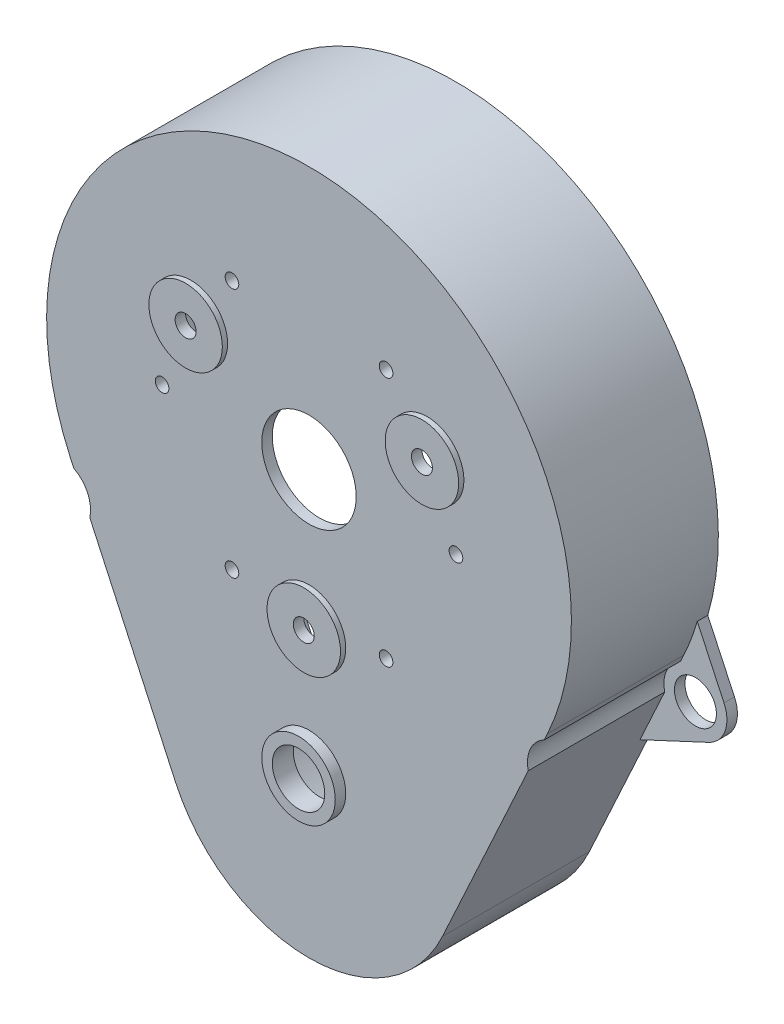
ISO-10303-21;
HEADER;
FILE_DESCRIPTION(('STEP AP214'),'2;1');
FILE_NAME('part.step','',(''),(''),'','','');
FILE_SCHEMA(('AUTOMOTIVE_DESIGN { 1 0 10303 214 1 1 1 1 }'));
ENDSEC;
DATA;
#1=APPLICATION_CONTEXT('core data for automotive mechanical design processes');
#2=APPLICATION_PROTOCOL_DEFINITION('international standard','automotive_design',2000,#1);
#3=PRODUCT_CONTEXT('',#1,'mechanical');
#4=PRODUCT('Part','Part','',(#3));
#5=PRODUCT_RELATED_PRODUCT_CATEGORY('part','',(#4));
#6=PRODUCT_DEFINITION_FORMATION('','',#4);
#7=PRODUCT_DEFINITION_CONTEXT('part definition',#1,'design');
#8=PRODUCT_DEFINITION('design','',#6,#7);
#9=PRODUCT_DEFINITION_SHAPE('','',#8);
#10=(LENGTH_UNIT() NAMED_UNIT(*) SI_UNIT(.MILLI.,.METRE.));
#11=(NAMED_UNIT(*) PLANE_ANGLE_UNIT() SI_UNIT($,.RADIAN.));
#12=(NAMED_UNIT(*) SI_UNIT($,.STERADIAN.) SOLID_ANGLE_UNIT());
#13=UNCERTAINTY_MEASURE_WITH_UNIT(LENGTH_MEASURE(1.E-05),#10,'distance_accuracy_value','');
#14=(GEOMETRIC_REPRESENTATION_CONTEXT(3) GLOBAL_UNCERTAINTY_ASSIGNED_CONTEXT((#13)) GLOBAL_UNIT_ASSIGNED_CONTEXT((#10,
#11,#12)) REPRESENTATION_CONTEXT('',''));
#15=CARTESIAN_POINT('',(0.,0.,0.));
#16=DIRECTION('',(0.,0.,1.));
#17=DIRECTION('',(1.,0.,0.));
#18=AXIS2_PLACEMENT_3D('',#15,#16,#17);
#19=CARTESIAN_POINT('',(0.,-26.3,14.));
#20=DIRECTION('',(0.,0.,1.));
#21=DIRECTION('',(1.,0.,0.));
#22=AXIS2_PLACEMENT_3D('',#19,#20,#21);
#23=PLANE('',#22);
#24=CARTESIAN_POINT('',(11.2583302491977,6.50000000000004,14.));
#25=DIRECTION('',(0.,0.,1.));
#26=DIRECTION('',(1.,0.,0.));
#27=AXIS2_PLACEMENT_3D('',#24,#25,#26);
#28=CIRCLE('',#27,3.5);
#29=CARTESIAN_POINT('',(14.7583302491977,6.50000000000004,14.));
#30=VERTEX_POINT('',#29);
#31=EDGE_CURVE('E332',#30,#30,#28,.T.);
#32=ORIENTED_EDGE('',*,*,#31,.F.);
#33=EDGE_LOOP('',(#32));
#34=FACE_BOUND('',#33,.T.);
#35=CARTESIAN_POINT('',(0.,-13.,14.));
#36=DIRECTION('',(0.,0.,1.));
#37=DIRECTION('',(1.,0.,0.));
#38=AXIS2_PLACEMENT_3D('',#35,#36,#37);
#39=CIRCLE('',#38,3.5);
#40=CARTESIAN_POINT('',(3.49999999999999,-13.,14.));
#41=VERTEX_POINT('',#40);
#42=EDGE_CURVE('E344',#41,#41,#39,.T.);
#43=ORIENTED_EDGE('',*,*,#42,.F.);
#44=EDGE_LOOP('',(#43));
#45=FACE_BOUND('',#44,.T.);
#46=CARTESIAN_POINT('',(0.,0.,14.));
#47=DIRECTION('',(0.,0.,-1.));
#48=DIRECTION('',(-1.,0.,0.));
#49=AXIS2_PLACEMENT_3D('',#46,#47,#48);
#50=CIRCLE('',#49,4.5);
#51=CARTESIAN_POINT('',(-4.5,0.,14.));
#52=VERTEX_POINT('',#51);
#53=EDGE_CURVE('E371',#52,#52,#50,.T.);
#54=ORIENTED_EDGE('',*,*,#53,.T.);
#55=EDGE_LOOP('',(#54));
#56=FACE_BOUND('',#55,.T.);
#57=CARTESIAN_POINT('',(7.34258809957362,11.92,14.));
#58=DIRECTION('',(0.,0.,-1.));
#59=DIRECTION('',(-1.,0.,0.));
#60=AXIS2_PLACEMENT_3D('',#57,#58,#59);
#61=CIRCLE('',#60,0.65);
#62=CARTESIAN_POINT('',(6.69258809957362,11.92,14.));
#63=VERTEX_POINT('',#62);
#64=EDGE_CURVE('E380',#63,#63,#61,.T.);
#65=ORIENTED_EDGE('',*,*,#64,.T.);
#66=EDGE_LOOP('',(#65));
#67=FACE_BOUND('',#66,.T.);
#68=CARTESIAN_POINT('',(14.,0.,14.));
#69=DIRECTION('',(0.,0.,-1.));
#70=DIRECTION('',(-1.,0.,0.));
#71=AXIS2_PLACEMENT_3D('',#68,#69,#70);
#72=CIRCLE('',#71,0.649999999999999);
#73=CARTESIAN_POINT('',(13.35,0.,14.));
#74=VERTEX_POINT('',#73);
#75=EDGE_CURVE('E386',#74,#74,#72,.T.);
#76=ORIENTED_EDGE('',*,*,#75,.T.);
#77=EDGE_LOOP('',(#76));
#78=FACE_BOUND('',#77,.T.);
#79=CARTESIAN_POINT('',(7.34258809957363,-11.92,14.));
#80=DIRECTION('',(0.,0.,-1.));
#81=DIRECTION('',(-1.,0.,0.));
#82=AXIS2_PLACEMENT_3D('',#79,#80,#81);
#83=CIRCLE('',#82,0.65);
#84=CARTESIAN_POINT('',(6.69258809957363,-11.92,14.));
#85=VERTEX_POINT('',#84);
#86=EDGE_CURVE('E392',#85,#85,#83,.T.);
#87=ORIENTED_EDGE('',*,*,#86,.T.);
#88=EDGE_LOOP('',(#87));
#89=FACE_BOUND('',#88,.T.);
#90=CARTESIAN_POINT('',(-7.34258809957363,-11.92,14.));
#91=DIRECTION('',(0.,0.,-1.));
#92=DIRECTION('',(-1.,0.,0.));
#93=AXIS2_PLACEMENT_3D('',#90,#91,#92);
#94=CIRCLE('',#93,0.65);
#95=CARTESIAN_POINT('',(-7.99258809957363,-11.92,14.));
#96=VERTEX_POINT('',#95);
#97=EDGE_CURVE('E398',#96,#96,#94,.T.);
#98=ORIENTED_EDGE('',*,*,#97,.T.);
#99=EDGE_LOOP('',(#98));
#100=FACE_BOUND('',#99,.T.);
#101=CARTESIAN_POINT('',(-14.,0.,14.));
#102=DIRECTION('',(0.,0.,-1.));
#103=DIRECTION('',(-1.,0.,0.));
#104=AXIS2_PLACEMENT_3D('',#101,#102,#103);
#105=CIRCLE('',#104,0.649999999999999);
#106=CARTESIAN_POINT('',(-14.65,0.,14.));
#107=VERTEX_POINT('',#106);
#108=EDGE_CURVE('E404',#107,#107,#105,.T.);
#109=ORIENTED_EDGE('',*,*,#108,.T.);
#110=EDGE_LOOP('',(#109));
#111=FACE_BOUND('',#110,.T.);
#112=CARTESIAN_POINT('',(-7.34258809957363,11.92,14.));
#113=DIRECTION('',(0.,0.,-1.));
#114=DIRECTION('',(-1.,0.,0.));
#115=AXIS2_PLACEMENT_3D('',#112,#113,#114);
#116=CIRCLE('',#115,0.65);
#117=CARTESIAN_POINT('',(-7.99258809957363,11.92,14.));
#118=VERTEX_POINT('',#117);
#119=EDGE_CURVE('E174',#118,#118,#116,.T.);
#120=ORIENTED_EDGE('',*,*,#119,.T.);
#121=EDGE_LOOP('',(#120));
#122=FACE_BOUND('',#121,.T.);
#123=DIRECTION('',(0.41825095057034,-0.9083315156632,0.));
#124=VECTOR('',#123,1.);
#125=CARTESIAN_POINT('',(-22.70828789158,-10.4562737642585,14.));
#126=LINE('',#125,#124);
#127=CARTESIAN_POINT('',(-22.70828789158,-10.4562737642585,14.));
#128=VERTEX_POINT('',#127);
#129=CARTESIAN_POINT('',(-22.4126566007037,-11.0983074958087,14.));
#130=VERTEX_POINT('',#129);
#131=EDGE_CURVE('E294',#128,#130,#126,.T.);
#132=ORIENTED_EDGE('',*,*,#131,.T.);
#133=CARTESIAN_POINT('',(-23.8156986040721,-13.7499999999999,14.));
#134=DIRECTION('',(0.,0.,1.));
#135=DIRECTION('',(1.,0.,0.));
#136=AXIS2_PLACEMENT_3D('',#133,#134,#135);
#137=CIRCLE('',#136,3.);
#138=CARTESIAN_POINT('',(-20.8887239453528,-14.407890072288,14.));
#139=VERTEX_POINT('',#138);
#140=EDGE_CURVE('E173',#139,#130,#137,.T.);
#141=ORIENTED_EDGE('',*,*,#140,.F.);
#142=CARTESIAN_POINT('',(-12.7166412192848,-32.1555133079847,14.));
#143=VERTEX_POINT('',#142);
#144=EDGE_CURVE('E182',#139,#143,#126,.T.);
#145=ORIENTED_EDGE('',*,*,#144,.T.);
#146=CARTESIAN_POINT('',(0.,-26.3,14.));
#147=DIRECTION('',(0.,0.,1.));
#148=DIRECTION('',(1.,0.,0.));
#149=AXIS2_PLACEMENT_3D('',#146,#147,#148);
#150=CIRCLE('',#149,14.);
#151=CARTESIAN_POINT('',(12.7166412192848,-32.1555133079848,14.));
#152=VERTEX_POINT('',#151);
#153=EDGE_CURVE('E285',#143,#152,#150,.T.);
#154=ORIENTED_EDGE('',*,*,#153,.T.);
#155=DIRECTION('',(0.41825095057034,0.908331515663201,0.));
#156=VECTOR('',#155,1.);
#157=CARTESIAN_POINT('',(12.7166412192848,-32.1555133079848,14.));
#158=LINE('',#157,#156);
#159=CARTESIAN_POINT('',(20.8887239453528,-14.407890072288,14.));
#160=VERTEX_POINT('',#159);
#161=EDGE_CURVE('E289',#152,#160,#158,.T.);
#162=ORIENTED_EDGE('',*,*,#161,.T.);
#163=CARTESIAN_POINT('',(23.8156986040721,-13.7499999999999,14.));
#164=DIRECTION('',(0.,0.,1.));
#165=DIRECTION('',(1.,0.,0.));
#166=AXIS2_PLACEMENT_3D('',#163,#164,#165);
#167=CIRCLE('',#166,3.);
#168=CARTESIAN_POINT('',(22.4126566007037,-11.0983074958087,14.));
#169=VERTEX_POINT('',#168);
#170=EDGE_CURVE('E415',#169,#160,#167,.T.);
#171=ORIENTED_EDGE('',*,*,#170,.F.);
#172=CARTESIAN_POINT('',(22.70828789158,-10.4562737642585,14.));
#173=VERTEX_POINT('',#172);
#174=EDGE_CURVE('E288',#169,#173,#158,.T.);
#175=ORIENTED_EDGE('',*,*,#174,.T.);
#176=CARTESIAN_POINT('',(0.,0.,14.));
#177=DIRECTION('',(0.,0.,1.));
#178=DIRECTION('',(1.,0.,0.));
#179=AXIS2_PLACEMENT_3D('',#176,#177,#178);
#180=CIRCLE('',#179,24.9999999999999);
#181=EDGE_CURVE('E292',#173,#128,#180,.T.);
#182=ORIENTED_EDGE('',*,*,#181,.T.);
#183=EDGE_LOOP('',(#132,#141,#145,#154,#162,#171,#175,#182));
#184=FACE_BOUND('',#183,.T.);
#185=CARTESIAN_POINT('',(-11.2583302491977,6.50000000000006,14.));
#186=DIRECTION('',(0.,0.,1.));
#187=DIRECTION('',(1.,0.,0.));
#188=AXIS2_PLACEMENT_3D('',#185,#186,#187);
#189=CIRCLE('',#188,3.5);
#190=CARTESIAN_POINT('',(-7.75833024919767,6.50000000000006,14.));
#191=VERTEX_POINT('',#190);
#192=EDGE_CURVE('E338',#191,#191,#189,.T.);
#193=ORIENTED_EDGE('',*,*,#192,.F.);
#194=EDGE_LOOP('',(#193));
#195=FACE_BOUND('',#194,.T.);
#196=CARTESIAN_POINT('',(0.,-25.,14.));
#197=DIRECTION('',(0.,0.,1.));
#198=DIRECTION('',(1.,0.,0.));
#199=AXIS2_PLACEMENT_3D('',#196,#197,#198);
#200=CIRCLE('',#199,3.5);
#201=CARTESIAN_POINT('',(3.5,-25.,14.));
#202=VERTEX_POINT('',#201);
#203=EDGE_CURVE('E326',#202,#202,#200,.T.);
#204=ORIENTED_EDGE('',*,*,#203,.F.);
#205=EDGE_LOOP('',(#204));
#206=FACE_BOUND('',#205,.T.);
#207=ADVANCED_FACE('F27',(#34,#45,#56,#67,#78,#89,#100,#111,#122,#184,#195,#206),#23,.T.);
#208=CARTESIAN_POINT('',(-22.70828789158,-10.4562737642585,14.));
#209=DIRECTION('',(0.908331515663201,0.41825095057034,0.));
#210=DIRECTION('',(-0.41825095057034,0.9083315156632,0.));
#211=AXIS2_PLACEMENT_3D('',#208,#209,#210);
#212=PLANE('',#211);
#213=DIRECTION('',(0.,0.,-1.));
#214=VECTOR('',#213,1.);
#215=CARTESIAN_POINT('',(-20.8887239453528,-14.407890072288,14.));
#216=LINE('',#215,#214);
#217=CARTESIAN_POINT('',(-20.8887239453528,-14.407890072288,1.));
#218=VERTEX_POINT('',#217);
#219=EDGE_CURVE('E168',#139,#218,#216,.T.);
#220=ORIENTED_EDGE('',*,*,#219,.T.);
#221=DIRECTION('',(0.41825095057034,-0.9083315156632,0.));
#222=VECTOR('',#221,1.);
#223=CARTESIAN_POINT('',(-22.70828789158,-10.4562737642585,1.));
#224=LINE('',#223,#222);
#225=CARTESIAN_POINT('',(-18.5332397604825,-19.5233847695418,1.));
#226=VERTEX_POINT('',#225);
#227=EDGE_CURVE('E179',#218,#226,#224,.T.);
#228=ORIENTED_EDGE('',*,*,#227,.T.);
#229=DIRECTION('',(0.,0.,-1.));
#230=VECTOR('',#229,1.);
#231=CARTESIAN_POINT('',(-18.5332397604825,-19.5233847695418,1.));
#232=LINE('',#231,#230);
#233=CARTESIAN_POINT('',(-18.5332397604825,-19.5233847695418,0.));
#234=VERTEX_POINT('',#233);
#235=EDGE_CURVE('E201',#226,#234,#232,.T.);
#236=ORIENTED_EDGE('',*,*,#235,.T.);
#237=DIRECTION('',(0.41825095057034,-0.9083315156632,0.));
#238=VECTOR('',#237,1.);
#239=CARTESIAN_POINT('',(-22.70828789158,-10.4562737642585,0.));
#240=LINE('',#239,#238);
#241=CARTESIAN_POINT('',(-12.7166412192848,-32.1555133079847,0.));
#242=VERTEX_POINT('',#241);
#243=EDGE_CURVE('E283',#234,#242,#240,.T.);
#244=ORIENTED_EDGE('',*,*,#243,.T.);
#245=DIRECTION('',(0.,0.,-1.));
#246=VECTOR('',#245,1.);
#247=CARTESIAN_POINT('',(-12.7166412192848,-32.1555133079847,14.));
#248=LINE('',#247,#246);
#249=EDGE_CURVE('E297',#143,#242,#248,.T.);
#250=ORIENTED_EDGE('',*,*,#249,.F.);
#251=ORIENTED_EDGE('',*,*,#144,.F.);
#252=EDGE_LOOP('',(#220,#228,#236,#244,#250,#251));
#253=FACE_BOUND('',#252,.T.);
#254=ADVANCED_FACE('F178',(#253),#212,.F.);
#255=DIRECTION('',(0.,0.,-1.));
#256=VECTOR('',#255,1.);
#257=CARTESIAN_POINT('',(-22.4126566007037,-11.0983074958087,14.));
#258=LINE('',#257,#256);
#259=CARTESIAN_POINT('',(-22.4126566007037,-11.0983074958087,1.));
#260=VERTEX_POINT('',#259);
#261=EDGE_CURVE('E171',#130,#260,#258,.T.);
#262=ORIENTED_EDGE('',*,*,#261,.F.);
#263=ORIENTED_EDGE('',*,*,#131,.F.);
#264=DIRECTION('',(0.,0.,-1.));
#265=VECTOR('',#264,1.);
#266=CARTESIAN_POINT('',(-22.70828789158,-10.4562737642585,14.));
#267=LINE('',#266,#265);
#268=CARTESIAN_POINT('',(-22.70828789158,-10.4562737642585,1.));
#269=VERTEX_POINT('',#268);
#270=EDGE_CURVE('E300',#128,#269,#267,.T.);
#271=ORIENTED_EDGE('',*,*,#270,.T.);
#272=EDGE_CURVE('E189',#269,#260,#224,.T.);
#273=ORIENTED_EDGE('',*,*,#272,.T.);
#274=EDGE_LOOP('',(#262,#263,#271,#273));
#275=FACE_BOUND('',#274,.T.);
#276=ADVANCED_FACE('F464',(#275),#212,.F.);
#277=CARTESIAN_POINT('',(12.7166412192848,-32.1555133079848,14.));
#278=DIRECTION('',(-0.908331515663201,0.41825095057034,0.));
#279=DIRECTION('',(-0.41825095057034,-0.908331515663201,0.));
#280=AXIS2_PLACEMENT_3D('',#277,#278,#279);
#281=PLANE('',#280);
#282=DIRECTION('',(0.,0.,-1.));
#283=VECTOR('',#282,1.);
#284=CARTESIAN_POINT('',(22.4126566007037,-11.0983074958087,14.));
#285=LINE('',#284,#283);
#286=CARTESIAN_POINT('',(22.4126566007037,-11.0983074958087,1.));
#287=VERTEX_POINT('',#286);
#288=EDGE_CURVE('E417',#169,#287,#285,.T.);
#289=ORIENTED_EDGE('',*,*,#288,.T.);
#290=DIRECTION('',(0.41825095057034,0.908331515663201,0.));
#291=VECTOR('',#290,1.);
#292=CARTESIAN_POINT('',(18.5332397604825,-19.5233847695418,1.));
#293=LINE('',#292,#291);
#294=CARTESIAN_POINT('',(22.70828789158,-10.4562737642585,1.));
#295=VERTEX_POINT('',#294);
#296=EDGE_CURVE('E232',#287,#295,#293,.T.);
#297=ORIENTED_EDGE('',*,*,#296,.T.);
#298=DIRECTION('',(0.,0.,-1.));
#299=VECTOR('',#298,1.);
#300=CARTESIAN_POINT('',(22.70828789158,-10.4562737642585,14.));
#301=LINE('',#300,#299);
#302=EDGE_CURVE('E36',#173,#295,#301,.T.);
#303=ORIENTED_EDGE('',*,*,#302,.F.);
#304=ORIENTED_EDGE('',*,*,#174,.F.);
#305=EDGE_LOOP('',(#289,#297,#303,#304));
#306=FACE_BOUND('',#305,.T.);
#307=ADVANCED_FACE('F491',(#306),#281,.F.);
#308=DIRECTION('',(0.,0.,-1.));
#309=VECTOR('',#308,1.);
#310=CARTESIAN_POINT('',(20.8887239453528,-14.407890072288,14.));
#311=LINE('',#310,#309);
#312=CARTESIAN_POINT('',(20.8887239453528,-14.407890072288,1.));
#313=VERTEX_POINT('',#312);
#314=EDGE_CURVE('E420',#160,#313,#311,.T.);
#315=ORIENTED_EDGE('',*,*,#314,.F.);
#316=ORIENTED_EDGE('',*,*,#161,.F.);
#317=DIRECTION('',(0.,0.,-1.));
#318=VECTOR('',#317,1.);
#319=CARTESIAN_POINT('',(12.7166412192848,-32.1555133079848,14.));
#320=LINE('',#319,#318);
#321=CARTESIAN_POINT('',(12.7166412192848,-32.1555133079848,0.));
#322=VERTEX_POINT('',#321);
#323=EDGE_CURVE('E11',#152,#322,#320,.T.);
#324=ORIENTED_EDGE('',*,*,#323,.T.);
#325=DIRECTION('',(0.41825095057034,0.908331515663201,0.));
#326=VECTOR('',#325,1.);
#327=CARTESIAN_POINT('',(12.7166412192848,-32.1555133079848,0.));
#328=LINE('',#327,#326);
#329=CARTESIAN_POINT('',(18.5332397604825,-19.5233847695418,0.));
#330=VERTEX_POINT('',#329);
#331=EDGE_CURVE('E279',#322,#330,#328,.T.);
#332=ORIENTED_EDGE('',*,*,#331,.T.);
#333=DIRECTION('',(0.,0.,-1.));
#334=VECTOR('',#333,1.);
#335=CARTESIAN_POINT('',(18.5332397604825,-19.5233847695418,1.));
#336=LINE('',#335,#334);
#337=CARTESIAN_POINT('',(18.5332397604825,-19.5233847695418,1.));
#338=VERTEX_POINT('',#337);
#339=EDGE_CURVE('E237',#338,#330,#336,.T.);
#340=ORIENTED_EDGE('',*,*,#339,.F.);
#341=EDGE_CURVE('E233',#338,#313,#293,.T.);
#342=ORIENTED_EDGE('',*,*,#341,.T.);
#343=EDGE_LOOP('',(#315,#316,#324,#332,#340,#342));
#344=FACE_BOUND('',#343,.T.);
#345=ADVANCED_FACE('F485',(#344),#281,.F.);
#346=CARTESIAN_POINT('',(0.,-26.3,14.));
#347=DIRECTION('',(0.,0.,-1.));
#348=DIRECTION('',(-1.,0.,0.));
#349=AXIS2_PLACEMENT_3D('',#346,#347,#348);
#350=CYLINDRICAL_SURFACE('',#349,14.);
#351=CARTESIAN_POINT('',(0.,-26.3,0.));
#352=DIRECTION('',(0.,0.,1.));
#353=DIRECTION('',(1.,0.,0.));
#354=AXIS2_PLACEMENT_3D('',#351,#352,#353);
#355=CIRCLE('',#354,14.);
#356=EDGE_CURVE('E249',#242,#322,#355,.T.);
#357=ORIENTED_EDGE('',*,*,#356,.T.);
#358=ORIENTED_EDGE('',*,*,#323,.F.);
#359=ORIENTED_EDGE('',*,*,#153,.F.);
#360=ORIENTED_EDGE('',*,*,#249,.T.);
#361=EDGE_LOOP('',(#357,#358,#359,#360));
#362=FACE_BOUND('',#361,.T.);
#363=ADVANCED_FACE('F29',(#362),#350,.T.);
#364=CARTESIAN_POINT('',(0.,0.,14.));
#365=DIRECTION('',(0.,0.,-1.));
#366=DIRECTION('',(-1.,0.,0.));
#367=AXIS2_PLACEMENT_3D('',#364,#365,#366);
#368=CYLINDRICAL_SURFACE('',#367,24.9999999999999);
#369=CARTESIAN_POINT('',(0.,0.,0.));
#370=DIRECTION('',(0.,0.,1.));
#371=DIRECTION('',(1.,0.,0.));
#372=AXIS2_PLACEMENT_3D('',#369,#370,#371);
#373=CIRCLE('',#372,24.9999999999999);
#374=CARTESIAN_POINT('',(23.9916214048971,-7.02866291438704,0.));
#375=VERTEX_POINT('',#374);
#376=CARTESIAN_POINT('',(-23.9916214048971,-7.02866291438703,0.));
#377=VERTEX_POINT('',#376);
#378=EDGE_CURVE('E281',#375,#377,#373,.T.);
#379=ORIENTED_EDGE('',*,*,#378,.T.);
#380=DIRECTION('',(0.,0.,-1.));
#381=VECTOR('',#380,1.);
#382=CARTESIAN_POINT('',(-23.9916214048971,-7.02866291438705,1.));
#383=LINE('',#382,#381);
#384=CARTESIAN_POINT('',(-23.9916214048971,-7.02866291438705,1.));
#385=VERTEX_POINT('',#384);
#386=EDGE_CURVE('E203',#385,#377,#383,.T.);
#387=ORIENTED_EDGE('',*,*,#386,.F.);
#388=CARTESIAN_POINT('',(0.,0.,1.));
#389=DIRECTION('',(0.,0.,1.));
#390=DIRECTION('',(-1.,0.,0.));
#391=AXIS2_PLACEMENT_3D('',#388,#389,#390);
#392=CIRCLE('',#391,24.9999999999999);
#393=EDGE_CURVE('E190',#385,#269,#392,.T.);
#394=ORIENTED_EDGE('',*,*,#393,.T.);
#395=ORIENTED_EDGE('',*,*,#270,.F.);
#396=ORIENTED_EDGE('',*,*,#181,.F.);
#397=ORIENTED_EDGE('',*,*,#302,.T.);
#398=CARTESIAN_POINT('',(0.,0.,1.));
#399=DIRECTION('',(0.,0.,1.));
#400=DIRECTION('',(-1.,0.,0.));
#401=AXIS2_PLACEMENT_3D('',#398,#399,#400);
#402=CIRCLE('',#401,24.9999999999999);
#403=CARTESIAN_POINT('',(23.9916214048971,-7.02866291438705,1.));
#404=VERTEX_POINT('',#403);
#405=EDGE_CURVE('E221',#295,#404,#402,.T.);
#406=ORIENTED_EDGE('',*,*,#405,.T.);
#407=DIRECTION('',(0.,0.,-1.));
#408=VECTOR('',#407,1.);
#409=CARTESIAN_POINT('',(23.9916214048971,-7.02866291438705,1.));
#410=LINE('',#409,#408);
#411=EDGE_CURVE('E236',#404,#375,#410,.T.);
#412=ORIENTED_EDGE('',*,*,#411,.T.);
#413=EDGE_LOOP('',(#379,#387,#394,#395,#396,#397,#406,#412));
#414=FACE_BOUND('',#413,.T.);
#415=ADVANCED_FACE('F468',(#414),#368,.T.);
#416=CARTESIAN_POINT('',(0.,-26.3,0.));
#417=DIRECTION('',(0.,0.,1.));
#418=DIRECTION('',(1.,0.,0.));
#419=AXIS2_PLACEMENT_3D('',#416,#417,#418);
#420=PLANE('',#419);
#421=ORIENTED_EDGE('',*,*,#243,.F.);
#422=DIRECTION('',(-0.906307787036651,0.422618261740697,0.));
#423=VECTOR('',#422,1.);
#424=CARTESIAN_POINT('',(-25.0835533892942,-16.4689233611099,0.));
#425=LINE('',#424,#423);
#426=CARTESIAN_POINT('',(-25.0835533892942,-16.4689233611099,0.));
#427=VERTEX_POINT('',#426);
#428=EDGE_CURVE('E434',#234,#427,#425,.T.);
#429=ORIENTED_EDGE('',*,*,#428,.T.);
#430=CARTESIAN_POINT('',(-23.8156986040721,-13.7499999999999,0.));
#431=DIRECTION('',(0.,0.,-1.));
#432=DIRECTION('',(-1.,0.,0.));
#433=AXIS2_PLACEMENT_3D('',#430,#431,#432);
#434=CIRCLE('',#433,3.);
#435=CARTESIAN_POINT('',(-26.5346219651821,-12.4821452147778,0.));
#436=VERTEX_POINT('',#435);
#437=EDGE_CURVE('E428',#427,#436,#434,.T.);
#438=ORIENTED_EDGE('',*,*,#437,.T.);
#439=DIRECTION('',(0.422618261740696,0.906307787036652,0.));
#440=VECTOR('',#439,1.);
#441=CARTESIAN_POINT('',(-23.9916214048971,-7.02866291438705,0.));
#442=LINE('',#441,#440);
#443=EDGE_CURVE('E431',#436,#377,#442,.T.);
#444=ORIENTED_EDGE('',*,*,#443,.T.);
#445=ORIENTED_EDGE('',*,*,#378,.F.);
#446=DIRECTION('',(0.422618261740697,-0.906307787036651,0.));
#447=VECTOR('',#446,1.);
#448=CARTESIAN_POINT('',(23.9916214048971,-7.02866291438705,0.));
#449=LINE('',#448,#447);
#450=CARTESIAN_POINT('',(26.5346219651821,-12.4821452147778,0.));
#451=VERTEX_POINT('',#450);
#452=EDGE_CURVE('E212',#375,#451,#449,.T.);
#453=ORIENTED_EDGE('',*,*,#452,.T.);
#454=CARTESIAN_POINT('',(23.8156986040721,-13.7499999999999,0.));
#455=DIRECTION('',(0.,0.,-1.));
#456=DIRECTION('',(-1.,0.,0.));
#457=AXIS2_PLACEMENT_3D('',#454,#455,#456);
#458=CIRCLE('',#457,3.);
#459=CARTESIAN_POINT('',(25.0835533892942,-16.4689233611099,0.));
#460=VERTEX_POINT('',#459);
#461=EDGE_CURVE('E215',#451,#460,#458,.T.);
#462=ORIENTED_EDGE('',*,*,#461,.T.);
#463=DIRECTION('',(-0.906307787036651,-0.422618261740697,0.));
#464=VECTOR('',#463,1.);
#465=CARTESIAN_POINT('',(25.0835533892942,-16.4689233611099,0.));
#466=LINE('',#465,#464);
#467=EDGE_CURVE('E218',#460,#330,#466,.T.);
#468=ORIENTED_EDGE('',*,*,#467,.T.);
#469=ORIENTED_EDGE('',*,*,#331,.F.);
#470=ORIENTED_EDGE('',*,*,#356,.F.);
#471=EDGE_LOOP('',(#421,#429,#438,#444,#445,#453,#462,#468,#469,#470));
#472=FACE_BOUND('',#471,.T.);
#473=DIRECTION('',(0.41825095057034,-0.9083315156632,0.));
#474=VECTOR('',#473,1.);
#475=CARTESIAN_POINT('',(-21.7999563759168,-10.0380228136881,0.));
#476=LINE('',#475,#474);
#477=CARTESIAN_POINT('',(-21.7999563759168,-10.0380228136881,0.));
#478=VERTEX_POINT('',#477);
#479=CARTESIAN_POINT('',(-11.8083097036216,-31.7372623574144,0.));
#480=VERTEX_POINT('',#479);
#481=EDGE_CURVE('E255',#478,#480,#476,.T.);
#482=ORIENTED_EDGE('',*,*,#481,.T.);
#483=CARTESIAN_POINT('',(0.,-26.3,0.));
#484=DIRECTION('',(0.,0.,1.));
#485=DIRECTION('',(1.,0.,0.));
#486=AXIS2_PLACEMENT_3D('',#483,#484,#485);
#487=CIRCLE('',#486,13.);
#488=CARTESIAN_POINT('',(11.8083097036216,-31.7372623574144,0.));
#489=VERTEX_POINT('',#488);
#490=EDGE_CURVE('E240',#480,#489,#487,.T.);
#491=ORIENTED_EDGE('',*,*,#490,.T.);
#492=DIRECTION('',(0.41825095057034,0.908331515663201,0.));
#493=VECTOR('',#492,1.);
#494=CARTESIAN_POINT('',(11.8083097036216,-31.7372623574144,0.));
#495=LINE('',#494,#493);
#496=CARTESIAN_POINT('',(21.7999563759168,-10.0380228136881,0.));
#497=VERTEX_POINT('',#496);
#498=EDGE_CURVE('E269',#489,#497,#495,.T.);
#499=ORIENTED_EDGE('',*,*,#498,.T.);
#500=CARTESIAN_POINT('',(0.,0.,0.));
#501=DIRECTION('',(0.,0.,1.));
#502=DIRECTION('',(1.,0.,0.));
#503=AXIS2_PLACEMENT_3D('',#500,#501,#502);
#504=CIRCLE('',#503,23.9999999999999);
#505=EDGE_CURVE('E272',#497,#478,#504,.T.);
#506=ORIENTED_EDGE('',*,*,#505,.T.);
#507=EDGE_LOOP('',(#482,#491,#499,#506));
#508=FACE_BOUND('',#507,.T.);
#509=CARTESIAN_POINT('',(23.8156986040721,-13.7499999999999,0.));
#510=DIRECTION('',(0.,0.,-1.));
#511=DIRECTION('',(-1.,0.,0.));
#512=AXIS2_PLACEMENT_3D('',#509,#510,#511);
#513=CIRCLE('',#512,2.);
#514=CARTESIAN_POINT('',(21.8156986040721,-13.7499999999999,0.));
#515=VERTEX_POINT('',#514);
#516=EDGE_CURVE('E200',#515,#515,#513,.T.);
#517=ORIENTED_EDGE('',*,*,#516,.F.);
#518=EDGE_LOOP('',(#517));
#519=FACE_BOUND('',#518,.T.);
#520=CARTESIAN_POINT('',(-23.8156986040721,-13.7499999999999,0.));
#521=DIRECTION('',(0.,0.,-1.));
#522=DIRECTION('',(-1.,0.,0.));
#523=AXIS2_PLACEMENT_3D('',#520,#521,#522);
#524=CIRCLE('',#523,2.);
#525=CARTESIAN_POINT('',(-25.8156986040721,-13.7499999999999,0.));
#526=VERTEX_POINT('',#525);
#527=EDGE_CURVE('E422',#526,#526,#524,.T.);
#528=ORIENTED_EDGE('',*,*,#527,.F.);
#529=EDGE_LOOP('',(#528));
#530=FACE_BOUND('',#529,.T.);
#531=ADVANCED_FACE('F454',(#472,#508,#519,#530),#420,.F.);
#532=CARTESIAN_POINT('',(0.,-26.3,14.));
#533=DIRECTION('',(0.,0.,-1.));
#534=DIRECTION('',(-1.,0.,0.));
#535=AXIS2_PLACEMENT_3D('',#532,#533,#534);
#536=CYLINDRICAL_SURFACE('',#535,13.);
#537=ORIENTED_EDGE('',*,*,#490,.F.);
#538=DIRECTION('',(0.,0.,-1.));
#539=VECTOR('',#538,1.);
#540=CARTESIAN_POINT('',(-11.8083097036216,-31.7372623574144,14.));
#541=LINE('',#540,#539);
#542=CARTESIAN_POINT('',(-11.8083097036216,-31.7372623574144,13.));
#543=VERTEX_POINT('',#542);
#544=EDGE_CURVE('E256',#543,#480,#541,.T.);
#545=ORIENTED_EDGE('',*,*,#544,.F.);
#546=CARTESIAN_POINT('',(0.,-26.3,13.));
#547=DIRECTION('',(0.,0.,1.));
#548=DIRECTION('',(1.,0.,0.));
#549=AXIS2_PLACEMENT_3D('',#546,#547,#548);
#550=CIRCLE('',#549,13.);
#551=CARTESIAN_POINT('',(11.8083097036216,-31.7372623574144,13.));
#552=VERTEX_POINT('',#551);
#553=EDGE_CURVE('E251',#543,#552,#550,.T.);
#554=ORIENTED_EDGE('',*,*,#553,.T.);
#555=DIRECTION('',(0.,0.,1.));
#556=VECTOR('',#555,1.);
#557=CARTESIAN_POINT('',(11.8083097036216,-31.7372623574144,14.));
#558=LINE('',#557,#556);
#559=EDGE_CURVE('E246',#552,#489,#558,.F.);
#560=ORIENTED_EDGE('',*,*,#559,.T.);
#561=EDGE_LOOP('',(#537,#545,#554,#560));
#562=FACE_BOUND('',#561,.T.);
#563=ADVANCED_FACE('F809',(#562),#536,.F.);
#564=CARTESIAN_POINT('',(11.8083097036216,-31.7372623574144,14.));
#565=DIRECTION('',(-0.908331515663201,0.41825095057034,0.));
#566=DIRECTION('',(-0.41825095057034,-0.908331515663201,0.));
#567=AXIS2_PLACEMENT_3D('',#564,#565,#566);
#568=PLANE('',#567);
#569=ORIENTED_EDGE('',*,*,#498,.F.);
#570=ORIENTED_EDGE('',*,*,#559,.F.);
#571=DIRECTION('',(0.41825095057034,0.908331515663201,0.));
#572=VECTOR('',#571,1.);
#573=CARTESIAN_POINT('',(11.8083097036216,-31.7372623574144,13.));
#574=LINE('',#573,#572);
#575=CARTESIAN_POINT('',(21.7999563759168,-10.0380228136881,13.));
#576=VERTEX_POINT('',#575);
#577=EDGE_CURVE('E254',#552,#576,#574,.T.);
#578=ORIENTED_EDGE('',*,*,#577,.T.);
#579=DIRECTION('',(0.,0.,-1.));
#580=VECTOR('',#579,1.);
#581=CARTESIAN_POINT('',(21.7999563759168,-10.0380228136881,14.));
#582=LINE('',#581,#580);
#583=EDGE_CURVE('E250',#576,#497,#582,.T.);
#584=ORIENTED_EDGE('',*,*,#583,.T.);
#585=EDGE_LOOP('',(#569,#570,#578,#584));
#586=FACE_BOUND('',#585,.T.);
#587=ADVANCED_FACE('F822',(#586),#568,.T.);
#588=CARTESIAN_POINT('',(0.,0.,14.));
#589=DIRECTION('',(0.,0.,-1.));
#590=DIRECTION('',(-1.,0.,0.));
#591=AXIS2_PLACEMENT_3D('',#588,#589,#590);
#592=CYLINDRICAL_SURFACE('',#591,23.9999999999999);
#593=ORIENTED_EDGE('',*,*,#505,.F.);
#594=ORIENTED_EDGE('',*,*,#583,.F.);
#595=CARTESIAN_POINT('',(0.,0.,13.));
#596=DIRECTION('',(0.,0.,1.));
#597=DIRECTION('',(1.,0.,0.));
#598=AXIS2_PLACEMENT_3D('',#595,#596,#597);
#599=CIRCLE('',#598,23.9999999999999);
#600=CARTESIAN_POINT('',(-21.7999563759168,-10.0380228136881,13.));
#601=VERTEX_POINT('',#600);
#602=EDGE_CURVE('E263',#576,#601,#599,.T.);
#603=ORIENTED_EDGE('',*,*,#602,.T.);
#604=DIRECTION('',(0.,0.,1.));
#605=VECTOR('',#604,1.);
#606=CARTESIAN_POINT('',(-21.7999563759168,-10.0380228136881,14.));
#607=LINE('',#606,#605);
#608=EDGE_CURVE('E258',#601,#478,#607,.F.);
#609=ORIENTED_EDGE('',*,*,#608,.T.);
#610=EDGE_LOOP('',(#593,#594,#603,#609));
#611=FACE_BOUND('',#610,.T.);
#612=ADVANCED_FACE('F830',(#611),#592,.F.);
#613=CARTESIAN_POINT('',(-21.7999563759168,-10.0380228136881,14.));
#614=DIRECTION('',(0.908331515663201,0.41825095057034,0.));
#615=DIRECTION('',(-0.41825095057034,0.9083315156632,0.));
#616=AXIS2_PLACEMENT_3D('',#613,#614,#615);
#617=PLANE('',#616);
#618=ORIENTED_EDGE('',*,*,#481,.F.);
#619=ORIENTED_EDGE('',*,*,#608,.F.);
#620=DIRECTION('',(0.41825095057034,-0.9083315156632,0.));
#621=VECTOR('',#620,1.);
#622=CARTESIAN_POINT('',(-21.7999563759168,-10.0380228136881,13.));
#623=LINE('',#622,#621);
#624=EDGE_CURVE('E259',#601,#543,#623,.T.);
#625=ORIENTED_EDGE('',*,*,#624,.T.);
#626=ORIENTED_EDGE('',*,*,#544,.T.);
#627=EDGE_LOOP('',(#618,#619,#625,#626));
#628=FACE_BOUND('',#627,.T.);
#629=ADVANCED_FACE('F838',(#628),#617,.T.);
#630=CARTESIAN_POINT('',(0.,-26.3,13.));
#631=DIRECTION('',(0.,0.,1.));
#632=DIRECTION('',(1.,0.,0.));
#633=AXIS2_PLACEMENT_3D('',#630,#631,#632);
#634=PLANE('',#633);
#635=CARTESIAN_POINT('',(11.2583302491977,6.50000000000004,13.));
#636=DIRECTION('',(0.,0.,-1.));
#637=DIRECTION('',(0.499999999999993,0.866025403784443,0.));
#638=AXIS2_PLACEMENT_3D('',#635,#636,#637);
#639=CIRCLE('',#638,3.5);
#640=CARTESIAN_POINT('',(13.0083302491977,9.53108891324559,13.));
#641=VERTEX_POINT('',#640);
#642=EDGE_CURVE('E350',#641,#641,#639,.T.);
#643=ORIENTED_EDGE('',*,*,#642,.F.);
#644=EDGE_LOOP('',(#643));
#645=FACE_BOUND('',#644,.T.);
#646=CARTESIAN_POINT('',(0.,-13.,13.));
#647=DIRECTION('',(0.,0.,-1.));
#648=DIRECTION('',(0.500000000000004,-0.866025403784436,0.));
#649=AXIS2_PLACEMENT_3D('',#646,#647,#648);
#650=CIRCLE('',#649,3.5);
#651=CARTESIAN_POINT('',(1.75,-16.0310889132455,13.));
#652=VERTEX_POINT('',#651);
#653=EDGE_CURVE('E356',#652,#652,#650,.T.);
#654=ORIENTED_EDGE('',*,*,#653,.F.);
#655=EDGE_LOOP('',(#654));
#656=FACE_BOUND('',#655,.T.);
#657=CARTESIAN_POINT('',(-11.2583302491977,6.50000000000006,13.));
#658=DIRECTION('',(0.,0.,-1.));
#659=DIRECTION('',(-1.,0.,0.));
#660=AXIS2_PLACEMENT_3D('',#657,#658,#659);
#661=CIRCLE('',#660,3.5);
#662=CARTESIAN_POINT('',(-14.7583302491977,6.50000000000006,13.));
#663=VERTEX_POINT('',#662);
#664=EDGE_CURVE('E362',#663,#663,#661,.T.);
#665=ORIENTED_EDGE('',*,*,#664,.F.);
#666=EDGE_LOOP('',(#665));
#667=FACE_BOUND('',#666,.T.);
#668=CARTESIAN_POINT('',(0.,0.,13.));
#669=DIRECTION('',(0.,0.,-1.));
#670=DIRECTION('',(-1.,0.,0.));
#671=AXIS2_PLACEMENT_3D('',#668,#669,#670);
#672=CIRCLE('',#671,4.5);
#673=CARTESIAN_POINT('',(-4.5,0.,13.));
#674=VERTEX_POINT('',#673);
#675=EDGE_CURVE('E368',#674,#674,#672,.T.);
#676=ORIENTED_EDGE('',*,*,#675,.F.);
#677=EDGE_LOOP('',(#676));
#678=FACE_BOUND('',#677,.T.);
#679=CARTESIAN_POINT('',(0.,-25.,13.));
#680=DIRECTION('',(0.,0.,-1.));
#681=DIRECTION('',(-1.,0.,0.));
#682=AXIS2_PLACEMENT_3D('',#679,#680,#681);
#683=CIRCLE('',#682,2.5);
#684=CARTESIAN_POINT('',(-2.5,-25.,13.));
#685=VERTEX_POINT('',#684);
#686=EDGE_CURVE('E374',#685,#685,#683,.T.);
#687=ORIENTED_EDGE('',*,*,#686,.F.);
#688=EDGE_LOOP('',(#687));
#689=FACE_BOUND('',#688,.T.);
#690=CARTESIAN_POINT('',(7.34258809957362,11.92,13.));
#691=DIRECTION('',(0.,0.,-1.));
#692=DIRECTION('',(-1.,0.,0.));
#693=AXIS2_PLACEMENT_3D('',#690,#691,#692);
#694=CIRCLE('',#693,0.65);
#695=CARTESIAN_POINT('',(6.69258809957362,11.92,13.));
#696=VERTEX_POINT('',#695);
#697=EDGE_CURVE('E377',#696,#696,#694,.T.);
#698=ORIENTED_EDGE('',*,*,#697,.F.);
#699=EDGE_LOOP('',(#698));
#700=FACE_BOUND('',#699,.T.);
#701=CARTESIAN_POINT('',(14.,0.,13.));
#702=DIRECTION('',(0.,0.,-1.));
#703=DIRECTION('',(-1.,0.,0.));
#704=AXIS2_PLACEMENT_3D('',#701,#702,#703);
#705=CIRCLE('',#704,0.649999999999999);
#706=CARTESIAN_POINT('',(13.35,0.,13.));
#707=VERTEX_POINT('',#706);
#708=EDGE_CURVE('E383',#707,#707,#705,.T.);
#709=ORIENTED_EDGE('',*,*,#708,.F.);
#710=EDGE_LOOP('',(#709));
#711=FACE_BOUND('',#710,.T.);
#712=CARTESIAN_POINT('',(7.34258809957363,-11.92,13.));
#713=DIRECTION('',(0.,0.,-1.));
#714=DIRECTION('',(-1.,0.,0.));
#715=AXIS2_PLACEMENT_3D('',#712,#713,#714);
#716=CIRCLE('',#715,0.65);
#717=CARTESIAN_POINT('',(6.69258809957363,-11.92,13.));
#718=VERTEX_POINT('',#717);
#719=EDGE_CURVE('E389',#718,#718,#716,.T.);
#720=ORIENTED_EDGE('',*,*,#719,.F.);
#721=EDGE_LOOP('',(#720));
#722=FACE_BOUND('',#721,.T.);
#723=CARTESIAN_POINT('',(-7.34258809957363,-11.92,13.));
#724=DIRECTION('',(0.,0.,-1.));
#725=DIRECTION('',(-1.,0.,0.));
#726=AXIS2_PLACEMENT_3D('',#723,#724,#725);
#727=CIRCLE('',#726,0.65);
#728=CARTESIAN_POINT('',(-7.99258809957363,-11.92,13.));
#729=VERTEX_POINT('',#728);
#730=EDGE_CURVE('E395',#729,#729,#727,.T.);
#731=ORIENTED_EDGE('',*,*,#730,.F.);
#732=EDGE_LOOP('',(#731));
#733=FACE_BOUND('',#732,.T.);
#734=CARTESIAN_POINT('',(-14.,0.,13.));
#735=DIRECTION('',(0.,0.,-1.));
#736=DIRECTION('',(-1.,0.,0.));
#737=AXIS2_PLACEMENT_3D('',#734,#735,#736);
#738=CIRCLE('',#737,0.649999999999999);
#739=CARTESIAN_POINT('',(-14.65,0.,13.));
#740=VERTEX_POINT('',#739);
#741=EDGE_CURVE('E401',#740,#740,#738,.T.);
#742=ORIENTED_EDGE('',*,*,#741,.F.);
#743=EDGE_LOOP('',(#742));
#744=FACE_BOUND('',#743,.T.);
#745=CARTESIAN_POINT('',(-7.34258809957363,11.92,13.));
#746=DIRECTION('',(0.,0.,-1.));
#747=DIRECTION('',(-1.,0.,0.));
#748=AXIS2_PLACEMENT_3D('',#745,#746,#747);
#749=CIRCLE('',#748,0.65);
#750=CARTESIAN_POINT('',(-7.99258809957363,11.92,13.));
#751=VERTEX_POINT('',#750);
#752=EDGE_CURVE('E407',#751,#751,#749,.T.);
#753=ORIENTED_EDGE('',*,*,#752,.F.);
#754=EDGE_LOOP('',(#753));
#755=FACE_BOUND('',#754,.T.);
#756=ORIENTED_EDGE('',*,*,#553,.F.);
#757=ORIENTED_EDGE('',*,*,#624,.F.);
#758=ORIENTED_EDGE('',*,*,#602,.F.);
#759=ORIENTED_EDGE('',*,*,#577,.F.);
#760=EDGE_LOOP('',(#756,#757,#758,#759));
#761=FACE_BOUND('',#760,.T.);
#762=ADVANCED_FACE('F802',(#645,#656,#667,#678,#689,#700,#711,#722,#733,#744,#755,#761),#634,.F.);
#763=CARTESIAN_POINT('',(25.0835533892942,-16.4689233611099,1.));
#764=DIRECTION('',(0.422618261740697,-0.906307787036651,0.));
#765=DIRECTION('',(0.906307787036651,0.422618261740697,0.));
#766=AXIS2_PLACEMENT_3D('',#763,#764,#765);
#767=PLANE('',#766);
#768=ORIENTED_EDGE('',*,*,#467,.F.);
#769=DIRECTION('',(0.,0.,-1.));
#770=VECTOR('',#769,1.);
#771=CARTESIAN_POINT('',(25.0835533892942,-16.4689233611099,1.));
#772=LINE('',#771,#770);
#773=CARTESIAN_POINT('',(25.0835533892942,-16.4689233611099,1.));
#774=VERTEX_POINT('',#773);
#775=EDGE_CURVE('E241',#774,#460,#772,.T.);
#776=ORIENTED_EDGE('',*,*,#775,.F.);
#777=DIRECTION('',(-0.906307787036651,-0.422618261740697,0.));
#778=VECTOR('',#777,1.);
#779=CARTESIAN_POINT('',(25.0835533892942,-16.4689233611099,1.));
#780=LINE('',#779,#778);
#781=EDGE_CURVE('E229',#774,#338,#780,.T.);
#782=ORIENTED_EDGE('',*,*,#781,.T.);
#783=ORIENTED_EDGE('',*,*,#339,.T.);
#784=EDGE_LOOP('',(#768,#776,#782,#783));
#785=FACE_BOUND('',#784,.T.);
#786=ADVANCED_FACE('F481',(#785),#767,.T.);
#787=CARTESIAN_POINT('',(23.8156986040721,-13.7499999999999,1.));
#788=DIRECTION('',(0.,0.,-1.));
#789=DIRECTION('',(-1.,0.,0.));
#790=AXIS2_PLACEMENT_3D('',#787,#788,#789);
#791=CYLINDRICAL_SURFACE('',#790,3.);
#792=ORIENTED_EDGE('',*,*,#461,.F.);
#793=DIRECTION('',(0.,0.,-1.));
#794=VECTOR('',#793,1.);
#795=CARTESIAN_POINT('',(26.5346219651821,-12.4821452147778,1.));
#796=LINE('',#795,#794);
#797=CARTESIAN_POINT('',(26.5346219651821,-12.4821452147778,1.));
#798=VERTEX_POINT('',#797);
#799=EDGE_CURVE('E243',#798,#451,#796,.T.);
#800=ORIENTED_EDGE('',*,*,#799,.F.);
#801=CARTESIAN_POINT('',(23.8156986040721,-13.7499999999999,1.));
#802=DIRECTION('',(0.,0.,-1.));
#803=DIRECTION('',(-1.,0.,0.));
#804=AXIS2_PLACEMENT_3D('',#801,#802,#803);
#805=CIRCLE('',#804,3.);
#806=EDGE_CURVE('E226',#798,#774,#805,.T.);
#807=ORIENTED_EDGE('',*,*,#806,.T.);
#808=ORIENTED_EDGE('',*,*,#775,.T.);
#809=EDGE_LOOP('',(#792,#800,#807,#808));
#810=FACE_BOUND('',#809,.T.);
#811=ADVANCED_FACE('F478',(#810),#791,.T.);
#812=CARTESIAN_POINT('',(23.9916214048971,-7.02866291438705,1.));
#813=DIRECTION('',(0.906307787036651,0.422618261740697,0.));
#814=DIRECTION('',(-0.422618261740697,0.906307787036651,0.));
#815=AXIS2_PLACEMENT_3D('',#812,#813,#814);
#816=PLANE('',#815);
#817=ORIENTED_EDGE('',*,*,#452,.F.);
#818=ORIENTED_EDGE('',*,*,#411,.F.);
#819=DIRECTION('',(0.422618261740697,-0.906307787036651,0.));
#820=VECTOR('',#819,1.);
#821=CARTESIAN_POINT('',(23.9916214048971,-7.02866291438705,1.));
#822=LINE('',#821,#820);
#823=EDGE_CURVE('E223',#404,#798,#822,.T.);
#824=ORIENTED_EDGE('',*,*,#823,.T.);
#825=ORIENTED_EDGE('',*,*,#799,.T.);
#826=EDGE_LOOP('',(#817,#818,#824,#825));
#827=FACE_BOUND('',#826,.T.);
#828=ADVANCED_FACE('F473',(#827),#816,.T.);
#829=CARTESIAN_POINT('',(0.,0.,1.));
#830=DIRECTION('',(0.,0.,-1.));
#831=DIRECTION('',(-1.,0.,0.));
#832=AXIS2_PLACEMENT_3D('',#829,#830,#831);
#833=PLANE('',#832);
#834=CARTESIAN_POINT('',(23.8156986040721,-13.7499999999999,1.));
#835=DIRECTION('',(0.,0.,-1.));
#836=DIRECTION('',(-1.,0.,0.));
#837=AXIS2_PLACEMENT_3D('',#834,#835,#836);
#838=CIRCLE('',#837,2.);
#839=CARTESIAN_POINT('',(21.8156986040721,-13.7499999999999,1.));
#840=VERTEX_POINT('',#839);
#841=EDGE_CURVE('E209',#840,#840,#838,.T.);
#842=ORIENTED_EDGE('',*,*,#841,.T.);
#843=EDGE_LOOP('',(#842));
#844=FACE_BOUND('',#843,.T.);
#845=ORIENTED_EDGE('',*,*,#405,.F.);
#846=ORIENTED_EDGE('',*,*,#296,.F.);
#847=CARTESIAN_POINT('',(23.8156986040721,-13.7499999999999,1.));
#848=DIRECTION('',(0.,0.,1.));
#849=DIRECTION('',(1.,0.,0.));
#850=AXIS2_PLACEMENT_3D('',#847,#848,#849);
#851=CIRCLE('',#850,3.);
#852=EDGE_CURVE('E52',#287,#313,#851,.T.);
#853=ORIENTED_EDGE('',*,*,#852,.T.);
#854=ORIENTED_EDGE('',*,*,#341,.F.);
#855=ORIENTED_EDGE('',*,*,#781,.F.);
#856=ORIENTED_EDGE('',*,*,#806,.F.);
#857=ORIENTED_EDGE('',*,*,#823,.F.);
#858=EDGE_LOOP('',(#845,#846,#853,#854,#855,#856,#857));
#859=FACE_BOUND('',#858,.T.);
#860=ADVANCED_FACE('F493',(#844,#859),#833,.F.);
#861=CARTESIAN_POINT('',(23.8156986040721,-13.7499999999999,1.));
#862=DIRECTION('',(0.,0.,-1.));
#863=DIRECTION('',(-1.,0.,0.));
#864=AXIS2_PLACEMENT_3D('',#861,#862,#863);
#865=CYLINDRICAL_SURFACE('',#864,2.);
#866=ORIENTED_EDGE('',*,*,#841,.F.);
#867=EDGE_LOOP('',(#866));
#868=FACE_BOUND('',#867,.T.);
#869=ORIENTED_EDGE('',*,*,#516,.T.);
#870=EDGE_LOOP('',(#869));
#871=FACE_BOUND('',#870,.T.);
#872=ADVANCED_FACE('F495',(#868,#871),#865,.F.);
#873=CARTESIAN_POINT('',(-23.8156986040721,-13.7499999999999,1.));
#874=DIRECTION('',(0.,0.,-1.));
#875=DIRECTION('',(-1.,0.,0.));
#876=AXIS2_PLACEMENT_3D('',#873,#874,#875);
#877=CYLINDRICAL_SURFACE('',#876,3.);
#878=ORIENTED_EDGE('',*,*,#437,.F.);
#879=DIRECTION('',(0.,0.,-1.));
#880=VECTOR('',#879,1.);
#881=CARTESIAN_POINT('',(-25.0835533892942,-16.4689233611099,1.));
#882=LINE('',#881,#880);
#883=CARTESIAN_POINT('',(-25.0835533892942,-16.4689233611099,1.));
#884=VERTEX_POINT('',#883);
#885=EDGE_CURVE('E198',#884,#427,#882,.T.);
#886=ORIENTED_EDGE('',*,*,#885,.F.);
#887=CARTESIAN_POINT('',(-23.8156986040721,-13.7499999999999,1.));
#888=DIRECTION('',(0.,0.,-1.));
#889=DIRECTION('',(-1.,0.,0.));
#890=AXIS2_PLACEMENT_3D('',#887,#888,#889);
#891=CIRCLE('',#890,3.);
#892=CARTESIAN_POINT('',(-26.5346219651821,-12.4821452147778,1.));
#893=VERTEX_POINT('',#892);
#894=EDGE_CURVE('E437',#884,#893,#891,.T.);
#895=ORIENTED_EDGE('',*,*,#894,.T.);
#896=DIRECTION('',(0.,0.,-1.));
#897=VECTOR('',#896,1.);
#898=CARTESIAN_POINT('',(-26.5346219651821,-12.4821452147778,1.));
#899=LINE('',#898,#897);
#900=EDGE_CURVE('E197',#893,#436,#899,.T.);
#901=ORIENTED_EDGE('',*,*,#900,.T.);
#902=EDGE_LOOP('',(#878,#886,#895,#901));
#903=FACE_BOUND('',#902,.T.);
#904=ADVANCED_FACE('F447',(#903),#877,.T.);
#905=CARTESIAN_POINT('',(-25.0835533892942,-16.4689233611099,1.));
#906=DIRECTION('',(-0.422618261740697,-0.906307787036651,0.));
#907=DIRECTION('',(0.906307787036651,-0.422618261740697,0.));
#908=AXIS2_PLACEMENT_3D('',#905,#906,#907);
#909=PLANE('',#908);
#910=ORIENTED_EDGE('',*,*,#428,.F.);
#911=ORIENTED_EDGE('',*,*,#235,.F.);
#912=DIRECTION('',(-0.906307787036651,0.422618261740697,0.));
#913=VECTOR('',#912,1.);
#914=CARTESIAN_POINT('',(-25.0835533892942,-16.4689233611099,1.));
#915=LINE('',#914,#913);
#916=EDGE_CURVE('E188',#226,#884,#915,.T.);
#917=ORIENTED_EDGE('',*,*,#916,.T.);
#918=ORIENTED_EDGE('',*,*,#885,.T.);
#919=EDGE_LOOP('',(#910,#911,#917,#918));
#920=FACE_BOUND('',#919,.T.);
#921=ADVANCED_FACE('F450',(#920),#909,.T.);
#922=CARTESIAN_POINT('',(-23.9916214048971,-7.02866291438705,1.));
#923=DIRECTION('',(-0.906307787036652,0.422618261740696,0.));
#924=DIRECTION('',(-0.422618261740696,-0.906307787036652,0.));
#925=AXIS2_PLACEMENT_3D('',#922,#923,#924);
#926=PLANE('',#925);
#927=ORIENTED_EDGE('',*,*,#443,.F.);
#928=ORIENTED_EDGE('',*,*,#900,.F.);
#929=DIRECTION('',(0.422618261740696,0.906307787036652,0.));
#930=VECTOR('',#929,1.);
#931=CARTESIAN_POINT('',(-23.9916214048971,-7.02866291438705,1.));
#932=LINE('',#931,#930);
#933=EDGE_CURVE('E192',#893,#385,#932,.T.);
#934=ORIENTED_EDGE('',*,*,#933,.T.);
#935=ORIENTED_EDGE('',*,*,#386,.T.);
#936=EDGE_LOOP('',(#927,#928,#934,#935));
#937=FACE_BOUND('',#936,.T.);
#938=ADVANCED_FACE('F443',(#937),#926,.T.);
#939=CARTESIAN_POINT('',(-23.8156986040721,-13.7499999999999,1.));
#940=DIRECTION('',(0.,0.,-1.));
#941=DIRECTION('',(-1.,0.,0.));
#942=AXIS2_PLACEMENT_3D('',#939,#940,#941);
#943=PLANE('',#942);
#944=CARTESIAN_POINT('',(-23.8156986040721,-13.7499999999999,1.));
#945=DIRECTION('',(0.,0.,-1.));
#946=DIRECTION('',(-1.,0.,0.));
#947=AXIS2_PLACEMENT_3D('',#944,#945,#946);
#948=CIRCLE('',#947,2.);
#949=CARTESIAN_POINT('',(-25.8156986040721,-13.7499999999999,1.));
#950=VERTEX_POINT('',#949);
#951=EDGE_CURVE('E425',#950,#950,#948,.T.);
#952=ORIENTED_EDGE('',*,*,#951,.T.);
#953=EDGE_LOOP('',(#952));
#954=FACE_BOUND('',#953,.T.);
#955=ORIENTED_EDGE('',*,*,#894,.F.);
#956=ORIENTED_EDGE('',*,*,#916,.F.);
#957=ORIENTED_EDGE('',*,*,#227,.F.);
#958=CARTESIAN_POINT('',(-23.8156986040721,-13.7499999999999,1.));
#959=DIRECTION('',(0.,0.,1.));
#960=DIRECTION('',(1.,0.,0.));
#961=AXIS2_PLACEMENT_3D('',#958,#959,#960);
#962=CIRCLE('',#961,3.);
#963=EDGE_CURVE('E44',#218,#260,#962,.T.);
#964=ORIENTED_EDGE('',*,*,#963,.T.);
#965=ORIENTED_EDGE('',*,*,#272,.F.);
#966=ORIENTED_EDGE('',*,*,#393,.F.);
#967=ORIENTED_EDGE('',*,*,#933,.F.);
#968=EDGE_LOOP('',(#955,#956,#957,#964,#965,#966,#967));
#969=FACE_BOUND('',#968,.T.);
#970=ADVANCED_FACE('F186',(#954,#969),#943,.F.);
#971=CARTESIAN_POINT('',(-23.8156986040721,-13.7499999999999,1.));
#972=DIRECTION('',(0.,0.,-1.));
#973=DIRECTION('',(-1.,0.,0.));
#974=AXIS2_PLACEMENT_3D('',#971,#972,#973);
#975=CYLINDRICAL_SURFACE('',#974,2.);
#976=ORIENTED_EDGE('',*,*,#951,.F.);
#977=EDGE_LOOP('',(#976));
#978=FACE_BOUND('',#977,.T.);
#979=ORIENTED_EDGE('',*,*,#527,.T.);
#980=EDGE_LOOP('',(#979));
#981=FACE_BOUND('',#980,.T.);
#982=ADVANCED_FACE('F539',(#978,#981),#975,.F.);
#983=CARTESIAN_POINT('',(23.8156986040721,-13.7499999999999,14.));
#984=DIRECTION('',(0.,0.,-1.));
#985=DIRECTION('',(-1.,0.,0.));
#986=AXIS2_PLACEMENT_3D('',#983,#984,#985);
#987=CYLINDRICAL_SURFACE('',#986,3.);
#988=ORIENTED_EDGE('',*,*,#852,.F.);
#989=ORIENTED_EDGE('',*,*,#288,.F.);
#990=ORIENTED_EDGE('',*,*,#170,.T.);
#991=ORIENTED_EDGE('',*,*,#314,.T.);
#992=EDGE_LOOP('',(#988,#989,#990,#991));
#993=FACE_BOUND('',#992,.T.);
#994=ADVANCED_FACE('F487',(#993),#987,.F.);
#995=CARTESIAN_POINT('',(-23.8156986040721,-13.7499999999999,14.));
#996=DIRECTION('',(0.,0.,-1.));
#997=DIRECTION('',(-1.,0.,0.));
#998=AXIS2_PLACEMENT_3D('',#995,#996,#997);
#999=CYLINDRICAL_SURFACE('',#998,3.);
#1000=ORIENTED_EDGE('',*,*,#963,.F.);
#1001=ORIENTED_EDGE('',*,*,#219,.F.);
#1002=ORIENTED_EDGE('',*,*,#140,.T.);
#1003=ORIENTED_EDGE('',*,*,#261,.T.);
#1004=EDGE_LOOP('',(#1000,#1001,#1002,#1003));
#1005=FACE_BOUND('',#1004,.T.);
#1006=ADVANCED_FACE('F167',(#1005),#999,.F.);
#1007=CARTESIAN_POINT('',(-7.34258809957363,11.92,14.));
#1008=DIRECTION('',(0.,0.,-1.));
#1009=DIRECTION('',(-1.,0.,0.));
#1010=AXIS2_PLACEMENT_3D('',#1007,#1008,#1009);
#1011=CYLINDRICAL_SURFACE('',#1010,0.65);
#1012=ORIENTED_EDGE('',*,*,#119,.F.);
#1013=EDGE_LOOP('',(#1012));
#1014=FACE_BOUND('',#1013,.T.);
#1015=ORIENTED_EDGE('',*,*,#752,.T.);
#1016=EDGE_LOOP('',(#1015));
#1017=FACE_BOUND('',#1016,.T.);
#1018=ADVANCED_FACE('F553',(#1014,#1017),#1011,.F.);
#1019=CARTESIAN_POINT('',(-14.,0.,14.));
#1020=DIRECTION('',(0.,0.,-1.));
#1021=DIRECTION('',(-1.,0.,0.));
#1022=AXIS2_PLACEMENT_3D('',#1019,#1020,#1021);
#1023=CYLINDRICAL_SURFACE('',#1022,0.649999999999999);
#1024=ORIENTED_EDGE('',*,*,#108,.F.);
#1025=EDGE_LOOP('',(#1024));
#1026=FACE_BOUND('',#1025,.T.);
#1027=ORIENTED_EDGE('',*,*,#741,.T.);
#1028=EDGE_LOOP('',(#1027));
#1029=FACE_BOUND('',#1028,.T.);
#1030=ADVANCED_FACE('F561',(#1026,#1029),#1023,.F.);
#1031=CARTESIAN_POINT('',(-7.34258809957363,-11.92,14.));
#1032=DIRECTION('',(0.,0.,-1.));
#1033=DIRECTION('',(-1.,0.,0.));
#1034=AXIS2_PLACEMENT_3D('',#1031,#1032,#1033);
#1035=CYLINDRICAL_SURFACE('',#1034,0.65);
#1036=ORIENTED_EDGE('',*,*,#97,.F.);
#1037=EDGE_LOOP('',(#1036));
#1038=FACE_BOUND('',#1037,.T.);
#1039=ORIENTED_EDGE('',*,*,#730,.T.);
#1040=EDGE_LOOP('',(#1039));
#1041=FACE_BOUND('',#1040,.T.);
#1042=ADVANCED_FACE('F569',(#1038,#1041),#1035,.F.);
#1043=CARTESIAN_POINT('',(7.34258809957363,-11.92,14.));
#1044=DIRECTION('',(0.,0.,-1.));
#1045=DIRECTION('',(-1.,0.,0.));
#1046=AXIS2_PLACEMENT_3D('',#1043,#1044,#1045);
#1047=CYLINDRICAL_SURFACE('',#1046,0.65);
#1048=ORIENTED_EDGE('',*,*,#86,.F.);
#1049=EDGE_LOOP('',(#1048));
#1050=FACE_BOUND('',#1049,.T.);
#1051=ORIENTED_EDGE('',*,*,#719,.T.);
#1052=EDGE_LOOP('',(#1051));
#1053=FACE_BOUND('',#1052,.T.);
#1054=ADVANCED_FACE('F577',(#1050,#1053),#1047,.F.);
#1055=CARTESIAN_POINT('',(14.,0.,14.));
#1056=DIRECTION('',(0.,0.,-1.));
#1057=DIRECTION('',(-1.,0.,0.));
#1058=AXIS2_PLACEMENT_3D('',#1055,#1056,#1057);
#1059=CYLINDRICAL_SURFACE('',#1058,0.649999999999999);
#1060=ORIENTED_EDGE('',*,*,#75,.F.);
#1061=EDGE_LOOP('',(#1060));
#1062=FACE_BOUND('',#1061,.T.);
#1063=ORIENTED_EDGE('',*,*,#708,.T.);
#1064=EDGE_LOOP('',(#1063));
#1065=FACE_BOUND('',#1064,.T.);
#1066=ADVANCED_FACE('F585',(#1062,#1065),#1059,.F.);
#1067=CARTESIAN_POINT('',(7.34258809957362,11.92,14.));
#1068=DIRECTION('',(0.,0.,-1.));
#1069=DIRECTION('',(-1.,0.,0.));
#1070=AXIS2_PLACEMENT_3D('',#1067,#1068,#1069);
#1071=CYLINDRICAL_SURFACE('',#1070,0.65);
#1072=ORIENTED_EDGE('',*,*,#64,.F.);
#1073=EDGE_LOOP('',(#1072));
#1074=FACE_BOUND('',#1073,.T.);
#1075=ORIENTED_EDGE('',*,*,#697,.T.);
#1076=EDGE_LOOP('',(#1075));
#1077=FACE_BOUND('',#1076,.T.);
#1078=ADVANCED_FACE('F593',(#1074,#1077),#1071,.F.);
#1079=CARTESIAN_POINT('',(0.,-25.,14.));
#1080=DIRECTION('',(0.,0.,-1.));
#1081=DIRECTION('',(-1.,0.,0.));
#1082=AXIS2_PLACEMENT_3D('',#1079,#1080,#1081);
#1083=CYLINDRICAL_SURFACE('',#1082,2.5);
#1084=ORIENTED_EDGE('',*,*,#686,.T.);
#1085=EDGE_LOOP('',(#1084));
#1086=FACE_BOUND('',#1085,.T.);
#1087=CARTESIAN_POINT('',(0.,-25.,15.));
#1088=DIRECTION('',(0.,0.,1.));
#1089=DIRECTION('',(1.,0.,0.));
#1090=AXIS2_PLACEMENT_3D('',#1087,#1088,#1089);
#1091=CIRCLE('',#1090,2.5);
#1092=CARTESIAN_POINT('',(2.5,-25.,15.));
#1093=VERTEX_POINT('',#1092);
#1094=EDGE_CURVE('E307',#1093,#1093,#1091,.T.);
#1095=ORIENTED_EDGE('',*,*,#1094,.T.);
#1096=EDGE_LOOP('',(#1095));
#1097=FACE_BOUND('',#1096,.T.);
#1098=ADVANCED_FACE('F601',(#1086,#1097),#1083,.F.);
#1099=CARTESIAN_POINT('',(0.,0.,14.));
#1100=DIRECTION('',(0.,0.,-1.));
#1101=DIRECTION('',(-1.,0.,0.));
#1102=AXIS2_PLACEMENT_3D('',#1099,#1100,#1101);
#1103=CYLINDRICAL_SURFACE('',#1102,4.5);
#1104=ORIENTED_EDGE('',*,*,#53,.F.);
#1105=EDGE_LOOP('',(#1104));
#1106=FACE_BOUND('',#1105,.T.);
#1107=ORIENTED_EDGE('',*,*,#675,.T.);
#1108=EDGE_LOOP('',(#1107));
#1109=FACE_BOUND('',#1108,.T.);
#1110=ADVANCED_FACE('F610',(#1106,#1109),#1103,.F.);
#1111=CARTESIAN_POINT('',(-11.2583302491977,6.50000000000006,13.5));
#1112=DIRECTION('',(0.,0.,-1.));
#1113=DIRECTION('',(-1.,0.,0.));
#1114=AXIS2_PLACEMENT_3D('',#1111,#1112,#1113);
#1115=CYLINDRICAL_SURFACE('',#1114,3.5);
#1116=CARTESIAN_POINT('',(-11.2583302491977,6.50000000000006,13.5));
#1117=DIRECTION('',(0.,0.,-1.));
#1118=DIRECTION('',(-1.,0.,0.));
#1119=AXIS2_PLACEMENT_3D('',#1116,#1117,#1118);
#1120=CIRCLE('',#1119,3.5);
#1121=CARTESIAN_POINT('',(-14.7583302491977,6.50000000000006,13.5));
#1122=VERTEX_POINT('',#1121);
#1123=EDGE_CURVE('E365',#1122,#1122,#1120,.T.);
#1124=ORIENTED_EDGE('',*,*,#1123,.F.);
#1125=EDGE_LOOP('',(#1124));
#1126=FACE_BOUND('',#1125,.T.);
#1127=ORIENTED_EDGE('',*,*,#664,.T.);
#1128=EDGE_LOOP('',(#1127));
#1129=FACE_BOUND('',#1128,.T.);
#1130=ADVANCED_FACE('F620',(#1126,#1129),#1115,.F.);
#1131=CARTESIAN_POINT('',(-11.2583302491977,6.50000000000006,13.5));
#1132=DIRECTION('',(0.,0.,-1.));
#1133=DIRECTION('',(-1.,0.,0.));
#1134=AXIS2_PLACEMENT_3D('',#1131,#1132,#1133);
#1135=PLANE('',#1134);
#1136=CARTESIAN_POINT('',(-11.2583302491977,6.50000000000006,13.5));
#1137=DIRECTION('',(0.,0.,-1.));
#1138=DIRECTION('',(-1.,0.,0.));
#1139=AXIS2_PLACEMENT_3D('',#1136,#1137,#1138);
#1140=CIRCLE('',#1139,0.999999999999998);
#1141=CARTESIAN_POINT('',(-12.2583302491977,6.50000000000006,13.5));
#1142=VERTEX_POINT('',#1141);
#1143=EDGE_CURVE('E308',#1142,#1142,#1140,.T.);
#1144=ORIENTED_EDGE('',*,*,#1143,.F.);
#1145=EDGE_LOOP('',(#1144));
#1146=FACE_BOUND('',#1145,.T.);
#1147=ORIENTED_EDGE('',*,*,#1123,.T.);
#1148=EDGE_LOOP('',(#1147));
#1149=FACE_BOUND('',#1148,.T.);
#1150=ADVANCED_FACE('F628',(#1146,#1149),#1135,.T.);
#1151=CARTESIAN_POINT('',(0.,-13.,13.5));
#1152=DIRECTION('',(0.,0.,-1.));
#1153=DIRECTION('',(-1.,0.,0.));
#1154=AXIS2_PLACEMENT_3D('',#1151,#1152,#1153);
#1155=CYLINDRICAL_SURFACE('',#1154,3.5);
#1156=CARTESIAN_POINT('',(0.,-13.,13.5));
#1157=DIRECTION('',(0.,0.,-1.));
#1158=DIRECTION('',(0.500000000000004,-0.866025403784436,0.));
#1159=AXIS2_PLACEMENT_3D('',#1156,#1157,#1158);
#1160=CIRCLE('',#1159,3.5);
#1161=CARTESIAN_POINT('',(1.75,-16.0310889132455,13.5));
#1162=VERTEX_POINT('',#1161);
#1163=EDGE_CURVE('E359',#1162,#1162,#1160,.T.);
#1164=ORIENTED_EDGE('',*,*,#1163,.F.);
#1165=EDGE_LOOP('',(#1164));
#1166=FACE_BOUND('',#1165,.T.);
#1167=ORIENTED_EDGE('',*,*,#653,.T.);
#1168=EDGE_LOOP('',(#1167));
#1169=FACE_BOUND('',#1168,.T.);
#1170=ADVANCED_FACE('F636',(#1166,#1169),#1155,.F.);
#1171=CARTESIAN_POINT('',(0.,-13.,13.5));
#1172=DIRECTION('',(0.,0.,-1.));
#1173=DIRECTION('',(0.500000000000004,-0.866025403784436,0.));
#1174=AXIS2_PLACEMENT_3D('',#1171,#1172,#1173);
#1175=PLANE('',#1174);
#1176=CARTESIAN_POINT('',(-1.75207071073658E-13,-13.,13.5));
#1177=DIRECTION('',(0.,0.,-1.));
#1178=DIRECTION('',(0.499999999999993,-0.866025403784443,0.));
#1179=AXIS2_PLACEMENT_3D('',#1176,#1177,#1178);
#1180=CIRCLE('',#1179,0.999999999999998);
#1181=CARTESIAN_POINT('',(0.499999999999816,-13.8660254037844,13.5));
#1182=VERTEX_POINT('',#1181);
#1183=EDGE_CURVE('E321',#1182,#1182,#1180,.T.);
#1184=ORIENTED_EDGE('',*,*,#1183,.F.);
#1185=EDGE_LOOP('',(#1184));
#1186=FACE_BOUND('',#1185,.T.);
#1187=ORIENTED_EDGE('',*,*,#1163,.T.);
#1188=EDGE_LOOP('',(#1187));
#1189=FACE_BOUND('',#1188,.T.);
#1190=ADVANCED_FACE('F644',(#1186,#1189),#1175,.T.);
#1191=CARTESIAN_POINT('',(11.2583302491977,6.50000000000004,13.5));
#1192=DIRECTION('',(0.,0.,-1.));
#1193=DIRECTION('',(0.,1.,0.));
#1194=AXIS2_PLACEMENT_3D('',#1191,#1192,#1193);
#1195=CYLINDRICAL_SURFACE('',#1194,3.5);
#1196=CARTESIAN_POINT('',(11.2583302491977,6.50000000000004,13.5));
#1197=DIRECTION('',(0.,0.,-1.));
#1198=DIRECTION('',(0.499999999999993,0.866025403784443,0.));
#1199=AXIS2_PLACEMENT_3D('',#1196,#1197,#1198);
#1200=CIRCLE('',#1199,3.5);
#1201=CARTESIAN_POINT('',(13.0083302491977,9.53108891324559,13.5));
#1202=VERTEX_POINT('',#1201);
#1203=EDGE_CURVE('E353',#1202,#1202,#1200,.T.);
#1204=ORIENTED_EDGE('',*,*,#1203,.F.);
#1205=EDGE_LOOP('',(#1204));
#1206=FACE_BOUND('',#1205,.T.);
#1207=ORIENTED_EDGE('',*,*,#642,.T.);
#1208=EDGE_LOOP('',(#1207));
#1209=FACE_BOUND('',#1208,.T.);
#1210=ADVANCED_FACE('F652',(#1206,#1209),#1195,.F.);
#1211=CARTESIAN_POINT('',(11.2583302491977,6.50000000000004,13.5));
#1212=DIRECTION('',(0.,0.,-1.));
#1213=DIRECTION('',(0.499999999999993,0.866025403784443,0.));
#1214=AXIS2_PLACEMENT_3D('',#1211,#1212,#1213);
#1215=PLANE('',#1214);
#1216=CARTESIAN_POINT('',(11.2583302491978,6.4999999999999,13.5));
#1217=DIRECTION('',(0.,0.,-1.));
#1218=DIRECTION('',(0.500000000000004,0.866025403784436,0.));
#1219=AXIS2_PLACEMENT_3D('',#1216,#1217,#1218);
#1220=CIRCLE('',#1219,0.999999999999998);
#1221=CARTESIAN_POINT('',(11.7583302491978,7.36602540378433,13.5));
#1222=VERTEX_POINT('',#1221);
#1223=EDGE_CURVE('E311',#1222,#1222,#1220,.T.);
#1224=ORIENTED_EDGE('',*,*,#1223,.F.);
#1225=EDGE_LOOP('',(#1224));
#1226=FACE_BOUND('',#1225,.T.);
#1227=ORIENTED_EDGE('',*,*,#1203,.T.);
#1228=EDGE_LOOP('',(#1227));
#1229=FACE_BOUND('',#1228,.T.);
#1230=ADVANCED_FACE('F660',(#1226,#1229),#1215,.T.);
#1231=CARTESIAN_POINT('',(0.,-13.,14.5));
#1232=DIRECTION('',(0.,0.,-1.));
#1233=DIRECTION('',(-1.,0.,0.));
#1234=AXIS2_PLACEMENT_3D('',#1231,#1232,#1233);
#1235=CYLINDRICAL_SURFACE('',#1234,3.5);
#1236=CARTESIAN_POINT('',(0.,-13.,14.5));
#1237=DIRECTION('',(0.,0.,1.));
#1238=DIRECTION('',(1.,0.,0.));
#1239=AXIS2_PLACEMENT_3D('',#1236,#1237,#1238);
#1240=CIRCLE('',#1239,3.5);
#1241=CARTESIAN_POINT('',(3.49999999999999,-13.,14.5));
#1242=VERTEX_POINT('',#1241);
#1243=EDGE_CURVE('E347',#1242,#1242,#1240,.T.);
#1244=ORIENTED_EDGE('',*,*,#1243,.F.);
#1245=EDGE_LOOP('',(#1244));
#1246=FACE_BOUND('',#1245,.T.);
#1247=ORIENTED_EDGE('',*,*,#42,.T.);
#1248=EDGE_LOOP('',(#1247));
#1249=FACE_BOUND('',#1248,.T.);
#1250=ADVANCED_FACE('F668',(#1246,#1249),#1235,.T.);
#1251=CARTESIAN_POINT('',(0.,-13.,14.5));
#1252=DIRECTION('',(0.,0.,1.));
#1253=DIRECTION('',(1.,0.,0.));
#1254=AXIS2_PLACEMENT_3D('',#1251,#1252,#1253);
#1255=PLANE('',#1254);
#1256=CARTESIAN_POINT('',(-1.75207071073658E-13,-13.,14.5));
#1257=DIRECTION('',(0.,0.,1.));
#1258=DIRECTION('',(1.,0.,0.));
#1259=AXIS2_PLACEMENT_3D('',#1256,#1257,#1258);
#1260=CIRCLE('',#1259,0.999999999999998);
#1261=CARTESIAN_POINT('',(0.999999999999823,-13.,14.5));
#1262=VERTEX_POINT('',#1261);
#1263=EDGE_CURVE('E31',#1262,#1262,#1260,.T.);
#1264=ORIENTED_EDGE('',*,*,#1263,.F.);
#1265=EDGE_LOOP('',(#1264));
#1266=FACE_BOUND('',#1265,.T.);
#1267=ORIENTED_EDGE('',*,*,#1243,.T.);
#1268=EDGE_LOOP('',(#1267));
#1269=FACE_BOUND('',#1268,.T.);
#1270=ADVANCED_FACE('F676',(#1266,#1269),#1255,.T.);
#1271=CARTESIAN_POINT('',(-11.2583302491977,6.50000000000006,14.5));
#1272=DIRECTION('',(0.,0.,-1.));
#1273=DIRECTION('',(-1.,0.,0.));
#1274=AXIS2_PLACEMENT_3D('',#1271,#1272,#1273);
#1275=CYLINDRICAL_SURFACE('',#1274,3.5);
#1276=CARTESIAN_POINT('',(-11.2583302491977,6.50000000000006,14.5));
#1277=DIRECTION('',(0.,0.,1.));
#1278=DIRECTION('',(1.,0.,0.));
#1279=AXIS2_PLACEMENT_3D('',#1276,#1277,#1278);
#1280=CIRCLE('',#1279,3.5);
#1281=CARTESIAN_POINT('',(-7.75833024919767,6.50000000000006,14.5));
#1282=VERTEX_POINT('',#1281);
#1283=EDGE_CURVE('E341',#1282,#1282,#1280,.T.);
#1284=ORIENTED_EDGE('',*,*,#1283,.F.);
#1285=EDGE_LOOP('',(#1284));
#1286=FACE_BOUND('',#1285,.T.);
#1287=ORIENTED_EDGE('',*,*,#192,.T.);
#1288=EDGE_LOOP('',(#1287));
#1289=FACE_BOUND('',#1288,.T.);
#1290=ADVANCED_FACE('F684',(#1286,#1289),#1275,.T.);
#1291=CARTESIAN_POINT('',(-11.2583302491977,6.50000000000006,14.5));
#1292=DIRECTION('',(0.,0.,1.));
#1293=DIRECTION('',(1.,0.,0.));
#1294=AXIS2_PLACEMENT_3D('',#1291,#1292,#1293);
#1295=PLANE('',#1294);
#1296=CARTESIAN_POINT('',(-11.2583302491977,6.50000000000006,14.5));
#1297=DIRECTION('',(0.,0.,1.));
#1298=DIRECTION('',(1.,0.,0.));
#1299=AXIS2_PLACEMENT_3D('',#1296,#1297,#1298);
#1300=CIRCLE('',#1299,0.999999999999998);
#1301=CARTESIAN_POINT('',(-10.2583302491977,6.50000000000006,14.5));
#1302=VERTEX_POINT('',#1301);
#1303=EDGE_CURVE('E305',#1302,#1302,#1300,.T.);
#1304=ORIENTED_EDGE('',*,*,#1303,.F.);
#1305=EDGE_LOOP('',(#1304));
#1306=FACE_BOUND('',#1305,.T.);
#1307=ORIENTED_EDGE('',*,*,#1283,.T.);
#1308=EDGE_LOOP('',(#1307));
#1309=FACE_BOUND('',#1308,.T.);
#1310=ADVANCED_FACE('F692',(#1306,#1309),#1295,.T.);
#1311=CARTESIAN_POINT('',(11.2583302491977,6.50000000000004,14.5));
#1312=DIRECTION('',(0.,0.,-1.));
#1313=DIRECTION('',(-1.,0.,0.));
#1314=AXIS2_PLACEMENT_3D('',#1311,#1312,#1313);
#1315=CYLINDRICAL_SURFACE('',#1314,3.5);
#1316=CARTESIAN_POINT('',(11.2583302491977,6.50000000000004,14.5));
#1317=DIRECTION('',(0.,0.,1.));
#1318=DIRECTION('',(1.,0.,0.));
#1319=AXIS2_PLACEMENT_3D('',#1316,#1317,#1318);
#1320=CIRCLE('',#1319,3.5);
#1321=CARTESIAN_POINT('',(14.7583302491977,6.50000000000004,14.5));
#1322=VERTEX_POINT('',#1321);
#1323=EDGE_CURVE('E335',#1322,#1322,#1320,.T.);
#1324=ORIENTED_EDGE('',*,*,#1323,.F.);
#1325=EDGE_LOOP('',(#1324));
#1326=FACE_BOUND('',#1325,.T.);
#1327=ORIENTED_EDGE('',*,*,#31,.T.);
#1328=EDGE_LOOP('',(#1327));
#1329=FACE_BOUND('',#1328,.T.);
#1330=ADVANCED_FACE('F700',(#1326,#1329),#1315,.T.);
#1331=CARTESIAN_POINT('',(11.2583302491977,6.50000000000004,14.5));
#1332=DIRECTION('',(0.,0.,1.));
#1333=DIRECTION('',(1.,0.,0.));
#1334=AXIS2_PLACEMENT_3D('',#1331,#1332,#1333);
#1335=PLANE('',#1334);
#1336=CARTESIAN_POINT('',(11.2583302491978,6.4999999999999,14.5));
#1337=DIRECTION('',(0.,0.,1.));
#1338=DIRECTION('',(1.,0.,0.));
#1339=AXIS2_PLACEMENT_3D('',#1336,#1337,#1338);
#1340=CIRCLE('',#1339,0.999999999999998);
#1341=CARTESIAN_POINT('',(12.2583302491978,6.4999999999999,14.5));
#1342=VERTEX_POINT('',#1341);
#1343=EDGE_CURVE('E309',#1342,#1342,#1340,.T.);
#1344=ORIENTED_EDGE('',*,*,#1343,.F.);
#1345=EDGE_LOOP('',(#1344));
#1346=FACE_BOUND('',#1345,.T.);
#1347=ORIENTED_EDGE('',*,*,#1323,.T.);
#1348=EDGE_LOOP('',(#1347));
#1349=FACE_BOUND('',#1348,.T.);
#1350=ADVANCED_FACE('F708',(#1346,#1349),#1335,.T.);
#1351=CARTESIAN_POINT('',(0.,-25.,15.));
#1352=DIRECTION('',(0.,0.,1.));
#1353=DIRECTION('',(1.,0.,0.));
#1354=AXIS2_PLACEMENT_3D('',#1351,#1352,#1353);
#1355=PLANE('',#1354);
#1356=CARTESIAN_POINT('',(0.,-25.,15.));
#1357=DIRECTION('',(0.,0.,1.));
#1358=DIRECTION('',(1.,0.,0.));
#1359=AXIS2_PLACEMENT_3D('',#1356,#1357,#1358);
#1360=CIRCLE('',#1359,3.5);
#1361=CARTESIAN_POINT('',(3.5,-25.,15.));
#1362=VERTEX_POINT('',#1361);
#1363=EDGE_CURVE('E329',#1362,#1362,#1360,.T.);
#1364=ORIENTED_EDGE('',*,*,#1363,.T.);
#1365=EDGE_LOOP('',(#1364));
#1366=FACE_BOUND('',#1365,.T.);
#1367=ORIENTED_EDGE('',*,*,#1094,.F.);
#1368=EDGE_LOOP('',(#1367));
#1369=FACE_BOUND('',#1368,.T.);
#1370=ADVANCED_FACE('F715',(#1366,#1369),#1355,.T.);
#1371=CARTESIAN_POINT('',(0.,-25.,15.));
#1372=DIRECTION('',(0.,0.,-1.));
#1373=DIRECTION('',(-1.,0.,0.));
#1374=AXIS2_PLACEMENT_3D('',#1371,#1372,#1373);
#1375=CYLINDRICAL_SURFACE('',#1374,3.5);
#1376=ORIENTED_EDGE('',*,*,#1363,.F.);
#1377=EDGE_LOOP('',(#1376));
#1378=FACE_BOUND('',#1377,.T.);
#1379=ORIENTED_EDGE('',*,*,#203,.T.);
#1380=EDGE_LOOP('',(#1379));
#1381=FACE_BOUND('',#1380,.T.);
#1382=ADVANCED_FACE('F724',(#1378,#1381),#1375,.T.);
#1383=CARTESIAN_POINT('',(-11.2583302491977,6.50000000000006,15.));
#1384=DIRECTION('',(0.,0.,-1.));
#1385=DIRECTION('',(-1.,0.,0.));
#1386=AXIS2_PLACEMENT_3D('',#1383,#1384,#1385);
#1387=CYLINDRICAL_SURFACE('',#1386,0.999999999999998);
#1388=ORIENTED_EDGE('',*,*,#1303,.T.);
#1389=EDGE_LOOP('',(#1388));
#1390=FACE_BOUND('',#1389,.T.);
#1391=ORIENTED_EDGE('',*,*,#1143,.T.);
#1392=EDGE_LOOP('',(#1391));
#1393=FACE_BOUND('',#1392,.T.);
#1394=ADVANCED_FACE('F732',(#1390,#1393),#1387,.F.);
#1395=CARTESIAN_POINT('',(11.2583302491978,6.4999999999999,15.));
#1396=DIRECTION('',(0.,0.,-1.));
#1397=DIRECTION('',(-1.,0.,0.));
#1398=AXIS2_PLACEMENT_3D('',#1395,#1396,#1397);
#1399=CYLINDRICAL_SURFACE('',#1398,0.999999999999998);
#1400=ORIENTED_EDGE('',*,*,#1343,.T.);
#1401=EDGE_LOOP('',(#1400));
#1402=FACE_BOUND('',#1401,.T.);
#1403=ORIENTED_EDGE('',*,*,#1223,.T.);
#1404=EDGE_LOOP('',(#1403));
#1405=FACE_BOUND('',#1404,.T.);
#1406=ADVANCED_FACE('F740',(#1402,#1405),#1399,.F.);
#1407=CARTESIAN_POINT('',(-1.75207071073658E-13,-13.,15.));
#1408=DIRECTION('',(0.,0.,-1.));
#1409=DIRECTION('',(-1.,0.,0.));
#1410=AXIS2_PLACEMENT_3D('',#1407,#1408,#1409);
#1411=CYLINDRICAL_SURFACE('',#1410,0.999999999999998);
#1412=ORIENTED_EDGE('',*,*,#1263,.T.);
#1413=EDGE_LOOP('',(#1412));
#1414=FACE_BOUND('',#1413,.T.);
#1415=ORIENTED_EDGE('',*,*,#1183,.T.);
#1416=EDGE_LOOP('',(#1415));
#1417=FACE_BOUND('',#1416,.T.);
#1418=ADVANCED_FACE('F748',(#1414,#1417),#1411,.F.);
#1419=CLOSED_SHELL('',(#207,#254,#276,#307,#345,#363,#415,#531,#563,#587,#612,#629,#762,#786,
#811,#828,#860,#872,#904,#921,#938,#970,#982,#994,#1006,#1018,#1030,#1042,#1054,#1066,#1078,
#1098,#1110,#1130,#1150,#1170,#1190,#1210,#1230,#1250,#1270,#1290,#1310,#1330,#1350,#1370,#1382,
#1394,#1406,#1418));
#1420=MANIFOLD_SOLID_BREP('B2',#1419);
#1421=ADVANCED_BREP_SHAPE_REPRESENTATION('',(#18,#1420),#14);
#1422=SHAPE_DEFINITION_REPRESENTATION(#9,#1421);
ENDSEC;
END-ISO-10303-21;
